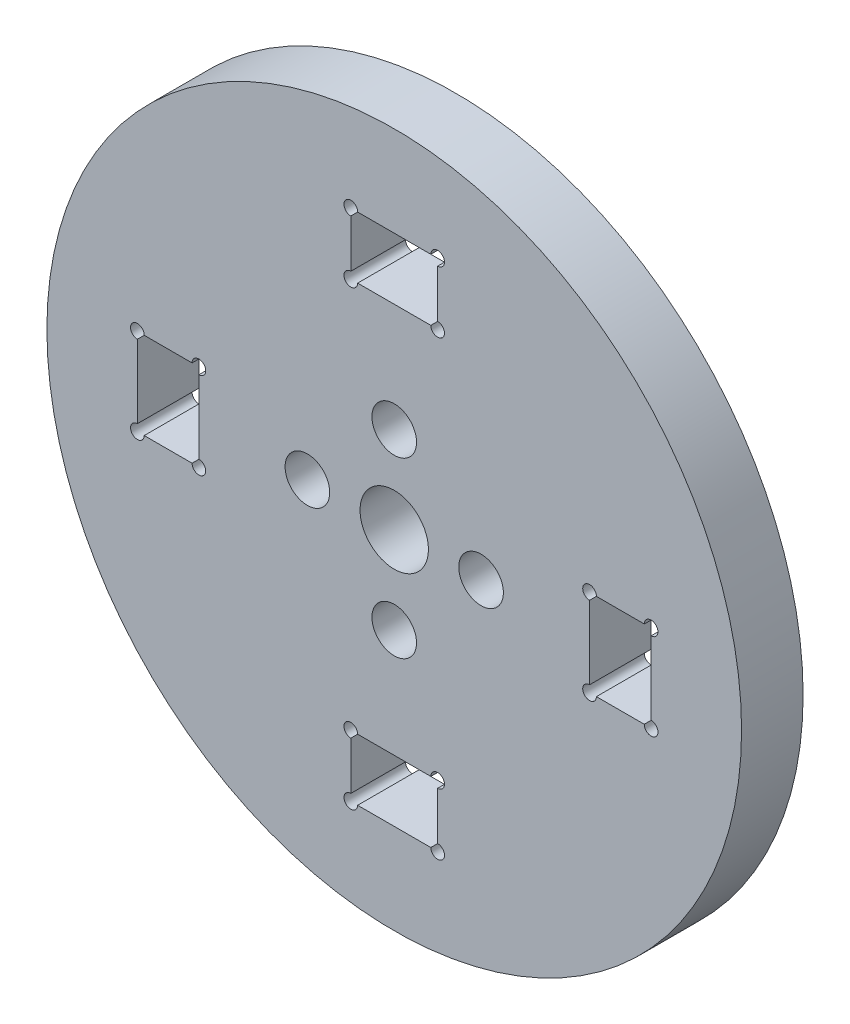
from build123d import *

# Parameters (mm, degrees)
SKETCH1_R                 = 25.4
SKETCH1_R_2               = 2.5
BOSS_EXTRUDE1_DEPTH       = 4.5
CUT_EXTRUDE1_DEPTH        = 37.201795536
F_4_CLEARANCE_HOLE1_D     = 3.2639
F_4_CLEARANCE_HOLE1_DEPTH = 25.4
F_4_CLEARANCE_HOLE1_TIP   = 0.980574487


with BuildPart() as part:
    # Sketch1 → Boss-Extrude1 (new body)
    with BuildSketch(Plane.XY):
        Circle(SKETCH1_R)
        Circle(SKETCH1_R_2, mode=Mode.SUBTRACT)
    extrude(amount=BOSS_EXTRUDE1_DEPTH)

    # Sketch2 → Cut-Extrude1 (cut, through all)
    with BuildSketch(Plane.XY.offset(4.5)):
        with BuildLine():
            Line((-14.783553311, 3.175), (-17.171437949, 3.175))
            ThreePointArc((-17.171437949, 3.175), (-17.4625, 0), (-17.171437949, -3.175))
            Line((-17.171437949, -3.175), (-14.783553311, -3.175))
            Line((-14.783553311, -3.175), (-14.283553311, -3.175))
            Line((-14.283553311, -3.175), (-14.283553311, -2.675))
            Line((-14.283553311, -2.675), (-14.283553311, 2.675))
            Line((-14.283553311, 2.675), (-14.283553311, 3.175))
            Line((-14.283553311, 3.175), (-14.783553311, 3.175))
        make_face()
        with BuildLine():
            ThreePointArc((-17.171437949, -3.175), (-17.4625, 0), (-17.171437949, 3.175))
            Line((-17.171437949, 3.175), (-18.283553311, 3.175))
            Line((-18.283553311, 3.175), (-18.783553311, 3.175))
            Line((-18.783553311, 3.175), (-18.783553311, 2.675))
            Line((-18.783553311, 2.675), (-18.783553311, -2.675))
            Line((-18.783553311, -2.675), (-18.783553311, -3.175))
            Line((-18.783553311, -3.175), (-18.283553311, -3.175))
            Line((-18.283553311, -3.175), (-17.171437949, -3.175))
        make_face()
        with BuildLine():
            Line((2.675, 18.783553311), (0, 18.783553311))
            Line((0, 18.783553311), (0, 17.4625))
            ThreePointArc((0, 17.4625), (1.594156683, 17.389582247), (3.175, 17.171437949))
            Line((3.175, 17.171437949), (3.175, 18.283553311))
            Line((3.175, 18.283553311), (3.175, 18.783553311))
            Line((3.175, 18.783553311), (2.675, 18.783553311))
        make_face()
        with BuildLine():
            Line((0, 17.4625), (0, 18.783553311))
            Line((0, 18.783553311), (-2.675, 18.783553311))
            Line((-2.675, 18.783553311), (-3.175, 18.783553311))
            Line((-3.175, 18.783553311), (-3.175, 18.283553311))
            Line((-3.175, 18.283553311), (-3.175, 17.171437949))
            ThreePointArc((-3.175, 17.171437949), (-1.594156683, 17.389582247), (0, 17.4625))
        make_face()
        with BuildLine():
            Line((0, 14.283553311), (0, 17.4625))
            ThreePointArc((0, 17.4625), (-1.594156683, 17.389582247), (-3.175, 17.171437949))
            Line((-3.175, 17.171437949), (-3.175, 14.783553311))
            Line((-3.175, 14.783553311), (-3.175, 14.283553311))
            Line((-3.175, 14.283553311), (-2.675, 14.283553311))
            Line((-2.675, 14.283553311), (0, 14.283553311))
        make_face()
        with BuildLine():
            ThreePointArc((3.175, 17.171437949), (1.594156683, 17.389582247), (0, 17.4625))
            Line((0, 17.4625), (0, 14.283553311))
            Line((0, 14.283553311), (2.675, 14.283553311))
            Line((2.675, 14.283553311), (3.175, 14.283553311))
            Line((3.175, 14.283553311), (3.175, 14.783553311))
            Line((3.175, 14.783553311), (3.175, 17.171437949))
        make_face()
        with BuildLine():
            ThreePointArc((17.4625, 0), (17.389582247, 1.594156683), (17.171437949, 3.175))
            Line((17.171437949, 3.175), (14.783553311, 3.175))
            Line((14.783553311, 3.175), (14.283553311, 3.175))
            Line((14.283553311, 3.175), (14.283553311, 2.675))
            Line((14.283553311, 2.675), (14.283553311, -2.675))
            Line((14.283553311, -2.675), (14.283553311, -3.175))
            Line((14.283553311, -3.175), (14.783553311, -3.175))
            Line((14.783553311, -3.175), (17.171437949, -3.175))
            ThreePointArc((17.171437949, -3.175), (17.389582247, -1.594156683), (17.4625, 0))
        make_face()
        with BuildLine():
            Line((18.283553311, 3.175), (17.171437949, 3.175))
            ThreePointArc((17.171437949, 3.175), (17.389582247, 1.594156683), (17.4625, 0))
            ThreePointArc((17.4625, 0), (17.389582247, -1.594156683), (17.171437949, -3.175))
            Line((17.171437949, -3.175), (18.283553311, -3.175))
            Line((18.283553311, -3.175), (18.783553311, -3.175))
            Line((18.783553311, -3.175), (18.783553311, -2.675))
            Line((18.783553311, -2.675), (18.783553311, 2.675))
            Line((18.783553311, 2.675), (18.783553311, 3.175))
            Line((18.783553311, 3.175), (18.283553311, 3.175))
        make_face()
        with BuildLine():
            Line((-3.175, -14.783553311), (-3.175, -17.171437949))
            ThreePointArc((-3.175, -17.171437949), (0, -17.4625), (3.175, -17.171437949))
            Line((3.175, -17.171437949), (3.175, -14.783553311))
            Line((3.175, -14.783553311), (3.175, -14.283553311))
            Line((3.175, -14.283553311), (2.675, -14.283553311))
            Line((2.675, -14.283553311), (-2.675, -14.283553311))
            Line((-2.675, -14.283553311), (-3.175, -14.283553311))
            Line((-3.175, -14.283553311), (-3.175, -14.783553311))
        make_face()
        with BuildLine():
            ThreePointArc((3.175, -17.171437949), (0, -17.4625), (-3.175, -17.171437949))
            Line((-3.175, -17.171437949), (-3.175, -18.283553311))
            Line((-3.175, -18.283553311), (-3.175, -18.783553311))
            Line((-3.175, -18.783553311), (-2.675, -18.783553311))
            Line((-2.675, -18.783553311), (2.675, -18.783553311))
            Line((2.675, -18.783553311), (3.175, -18.783553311))
            Line((3.175, -18.783553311), (3.175, -18.283553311))
            Line((3.175, -18.283553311), (3.175, -17.171437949))
        make_face()
        with BuildLine():
            Line((-3.175, 18.283553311), (-3.175, 18.783553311))
            ThreePointArc((-3.175, 18.783553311), (-3.421229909, 18.740269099), (-3.66687058, 18.693757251))
            ThreePointArc((-3.66687058, 18.693757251), (-3.495235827, 18.399562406), (-3.175, 18.283553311))
        make_face()
        with BuildLine():
            Line((-3.175, 18.783553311), (-2.675, 18.783553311))
            ThreePointArc((-2.675, 18.783553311), (-2.676487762, 18.822096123), (-2.680942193, 18.860409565))
            ThreePointArc((-2.680942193, 18.860409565), (-2.928223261, 18.823602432), (-3.175, 18.783553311))
        make_face()
        with BuildLine():
            ThreePointArc((-3.66687058, 18.693757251), (-3.421229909, 18.740269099), (-3.175, 18.783553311))
            ThreePointArc((-3.175, 18.783553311), (-2.928223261, 18.823602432), (-2.680942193, 18.860409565))
            ThreePointArc((-2.680942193, 18.860409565), (-3.258333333, 19.27655996), (-3.66687058, 18.693757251))
        make_face()
        with BuildLine():
            ThreePointArc((2.680942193, 18.860409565), (2.676487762, 18.822096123), (2.675, 18.783553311))
            Line((2.675, 18.783553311), (3.175, 18.783553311))
            ThreePointArc((3.175, 18.783553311), (2.928223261, 18.823602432), (2.680942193, 18.860409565))
        make_face()
        with BuildLine():
            ThreePointArc((2.680942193, 18.860409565), (2.928223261, 18.823602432), (3.175, 18.783553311))
            ThreePointArc((3.175, 18.783553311), (3.421229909, 18.740269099), (3.66687058, 18.693757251))
            ThreePointArc((3.66687058, 18.693757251), (3.258333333, 19.27655996), (2.680942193, 18.860409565))
        make_face()
        with BuildLine():
            ThreePointArc((3.66687058, 18.693757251), (3.421229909, 18.740269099), (3.175, 18.783553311))
            Line((3.175, 18.783553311), (3.175, 18.283553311))
            ThreePointArc((3.175, 18.283553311), (3.495235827, 18.399562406), (3.66687058, 18.693757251))
        make_face()
        with BuildLine():
            Line((3.175, 14.283553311), (2.675, 14.283553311))
            ThreePointArc((2.675, 14.283553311), (3.528553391, 13.929999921), (3.175, 14.783553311))
            Line((3.175, 14.783553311), (3.175, 14.283553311))
        make_face()
        with BuildLine():
            ThreePointArc((-3.175, 14.783553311), (-3.528553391, 13.929999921), (-2.675, 14.283553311))
            Line((-2.675, 14.283553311), (-3.175, 14.283553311))
            Line((-3.175, 14.283553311), (-3.175, 14.783553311))
        make_face()
        with BuildLine():
            Line((14.283553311, -3.175), (14.283553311, -2.675))
            ThreePointArc((14.283553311, -2.675), (13.929999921, -3.528553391), (14.783553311, -3.175))
            Line((14.783553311, -3.175), (14.283553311, -3.175))
        make_face()
        with BuildLine():
            Line((14.283553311, 3.175), (14.783553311, 3.175))
            ThreePointArc((14.783553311, 3.175), (13.929999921, 3.528553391), (14.283553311, 2.675))
            Line((14.283553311, 2.675), (14.283553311, 3.175))
        make_face()
        with BuildLine():
            ThreePointArc((18.693757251, 3.66687058), (18.399562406, 3.495235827), (18.283553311, 3.175))
            Line((18.283553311, 3.175), (18.783553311, 3.175))
            ThreePointArc((18.783553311, 3.175), (18.740269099, 3.421229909), (18.693757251, 3.66687058))
        make_face()
        with BuildLine():
            ThreePointArc((18.860409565, 2.680942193), (19.27655996, 3.258333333), (18.693757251, 3.66687058))
            ThreePointArc((18.693757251, 3.66687058), (18.740269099, 3.421229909), (18.783553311, 3.175))
            ThreePointArc((18.783553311, 3.175), (18.823602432, 2.928223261), (18.860409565, 2.680942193))
        make_face()
        with BuildLine():
            ThreePointArc((18.860409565, 2.680942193), (18.823602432, 2.928223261), (18.783553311, 3.175))
            Line((18.783553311, 3.175), (18.783553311, 2.675))
            ThreePointArc((18.783553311, 2.675), (18.822096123, 2.676487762), (18.860409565, 2.680942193))
        make_face()
        with BuildLine():
            Line((18.783553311, -3.175), (18.283553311, -3.175))
            ThreePointArc((18.283553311, -3.175), (18.399562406, -3.495235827), (18.693757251, -3.66687058))
            ThreePointArc((18.693757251, -3.66687058), (18.740269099, -3.421229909), (18.783553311, -3.175))
        make_face()
        with BuildLine():
            ThreePointArc((18.860409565, -2.680942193), (18.823602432, -2.928223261), (18.783553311, -3.175))
            ThreePointArc((18.783553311, -3.175), (18.740269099, -3.421229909), (18.693757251, -3.66687058))
            ThreePointArc((18.693757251, -3.66687058), (19.27655996, -3.258333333), (18.860409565, -2.680942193))
        make_face()
        with BuildLine():
            ThreePointArc((18.860409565, -2.680942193), (18.822096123, -2.676487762), (18.783553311, -2.675))
            Line((18.783553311, -2.675), (18.783553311, -3.175))
            ThreePointArc((18.783553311, -3.175), (18.823602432, -2.928223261), (18.860409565, -2.680942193))
        make_face()
        with BuildLine():
            ThreePointArc((-3.175, -18.783553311), (-3.421229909, -18.740269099), (-3.66687058, -18.693757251))
            ThreePointArc((-3.66687058, -18.693757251), (-3.258333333, -19.27655996), (-2.680942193, -18.860409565))
            ThreePointArc((-2.680942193, -18.860409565), (-2.928223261, -18.823602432), (-3.175, -18.783553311))
        make_face()
        with BuildLine():
            ThreePointArc((-2.675, -14.283553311), (-3.528553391, -13.929999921), (-3.175, -14.783553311))
            Line((-3.175, -14.783553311), (-3.175, -14.283553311))
            Line((-3.175, -14.283553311), (-2.675, -14.283553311))
        make_face()
        with BuildLine():
            Line((3.175, -14.283553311), (3.175, -14.783553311))
            ThreePointArc((3.175, -14.783553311), (3.528553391, -13.929999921), (2.675, -14.283553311))
            Line((2.675, -14.283553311), (3.175, -14.283553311))
        make_face()
        with BuildLine():
            ThreePointArc((2.680942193, -18.860409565), (3.258333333, -19.27655996), (3.66687058, -18.693757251))
            ThreePointArc((3.66687058, -18.693757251), (3.421229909, -18.740269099), (3.175, -18.783553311))
            ThreePointArc((3.175, -18.783553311), (2.928223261, -18.823602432), (2.680942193, -18.860409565))
        make_face()
        with BuildLine():
            ThreePointArc((3.66687058, -18.693757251), (3.495235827, -18.399562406), (3.175, -18.283553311))
            Line((3.175, -18.283553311), (3.175, -18.783553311))
            ThreePointArc((3.175, -18.783553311), (3.421229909, -18.740269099), (3.66687058, -18.693757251))
        make_face()
        with BuildLine():
            ThreePointArc((2.680942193, -18.860409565), (2.928223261, -18.823602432), (3.175, -18.783553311))
            Line((3.175, -18.783553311), (2.675, -18.783553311))
            ThreePointArc((2.675, -18.783553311), (2.676487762, -18.822096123), (2.680942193, -18.860409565))
        make_face()
        with BuildLine():
            Line((-3.175, -18.783553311), (-3.175, -18.283553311))
            ThreePointArc((-3.175, -18.283553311), (-3.495235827, -18.399562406), (-3.66687058, -18.693757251))
            ThreePointArc((-3.66687058, -18.693757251), (-3.421229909, -18.740269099), (-3.175, -18.783553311))
        make_face()
        with BuildLine():
            Line((-2.675, -18.783553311), (-3.175, -18.783553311))
            ThreePointArc((-3.175, -18.783553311), (-2.928223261, -18.823602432), (-2.680942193, -18.860409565))
            ThreePointArc((-2.680942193, -18.860409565), (-2.676487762, -18.822096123), (-2.675, -18.783553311))
        make_face()
        with BuildLine():
            ThreePointArc((-18.783553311, 3.175), (-18.740269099, 3.421229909), (-18.693757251, 3.66687058))
            ThreePointArc((-18.693757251, 3.66687058), (-19.27655996, 3.258333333), (-18.860409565, 2.680942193))
            ThreePointArc((-18.860409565, 2.680942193), (-18.823602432, 2.928223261), (-18.783553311, 3.175))
        make_face()
        with BuildLine():
            Line((-18.783553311, 3.175), (-18.283553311, 3.175))
            ThreePointArc((-18.283553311, 3.175), (-18.399562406, 3.495235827), (-18.693757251, 3.66687058))
            ThreePointArc((-18.693757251, 3.66687058), (-18.740269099, 3.421229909), (-18.783553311, 3.175))
        make_face()
        with BuildLine():
            Line((-18.783553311, 2.675), (-18.783553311, 3.175))
            ThreePointArc((-18.783553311, 3.175), (-18.823602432, 2.928223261), (-18.860409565, 2.680942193))
            ThreePointArc((-18.860409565, 2.680942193), (-18.822096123, 2.676487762), (-18.783553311, 2.675))
        make_face()
        with BuildLine():
            ThreePointArc((-14.283553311, 2.675), (-13.929999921, 3.528553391), (-14.783553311, 3.175))
            Line((-14.783553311, 3.175), (-14.283553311, 3.175))
            Line((-14.283553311, 3.175), (-14.283553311, 2.675))
        make_face()
        with BuildLine():
            Line((-14.283553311, -3.175), (-14.783553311, -3.175))
            ThreePointArc((-14.783553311, -3.175), (-13.929999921, -3.528553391), (-14.283553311, -2.675))
            Line((-14.283553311, -2.675), (-14.283553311, -3.175))
        make_face()
        with BuildLine():
            ThreePointArc((-18.693757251, -3.66687058), (-18.399562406, -3.495235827), (-18.283553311, -3.175))
            Line((-18.283553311, -3.175), (-18.783553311, -3.175))
            ThreePointArc((-18.783553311, -3.175), (-18.740269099, -3.421229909), (-18.693757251, -3.66687058))
        make_face()
        with BuildLine():
            ThreePointArc((-18.693757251, -3.66687058), (-18.740269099, -3.421229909), (-18.783553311, -3.175))
            ThreePointArc((-18.783553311, -3.175), (-18.823602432, -2.928223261), (-18.860409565, -2.680942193))
            ThreePointArc((-18.860409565, -2.680942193), (-19.27655996, -3.258333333), (-18.693757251, -3.66687058))
        make_face()
        with BuildLine():
            ThreePointArc((-18.860409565, -2.680942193), (-18.823602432, -2.928223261), (-18.783553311, -3.175))
            Line((-18.783553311, -3.175), (-18.783553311, -2.675))
            ThreePointArc((-18.783553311, -2.675), (-18.822096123, -2.676487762), (-18.860409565, -2.680942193))
        make_face()
    extrude(amount=-CUT_EXTRUDE1_DEPTH, mode=Mode.SUBTRACT)

    # 4 Clearance Hole1
    with Locations(Plane.XY.offset(4.5)):
        with Locations((0, 6.35), (6.35, 0), (0, -6.35), (-6.35, 0)):
            Hole(F_4_CLEARANCE_HOLE1_D / 2, depth=F_4_CLEARANCE_HOLE1_DEPTH)
            with Locations((0, 0, -(F_4_CLEARANCE_HOLE1_DEPTH + F_4_CLEARANCE_HOLE1_TIP / 2))):  # 118° drill point
                Cone(0, F_4_CLEARANCE_HOLE1_D / 2, F_4_CLEARANCE_HOLE1_TIP, mode=Mode.SUBTRACT)


solid = part.part
